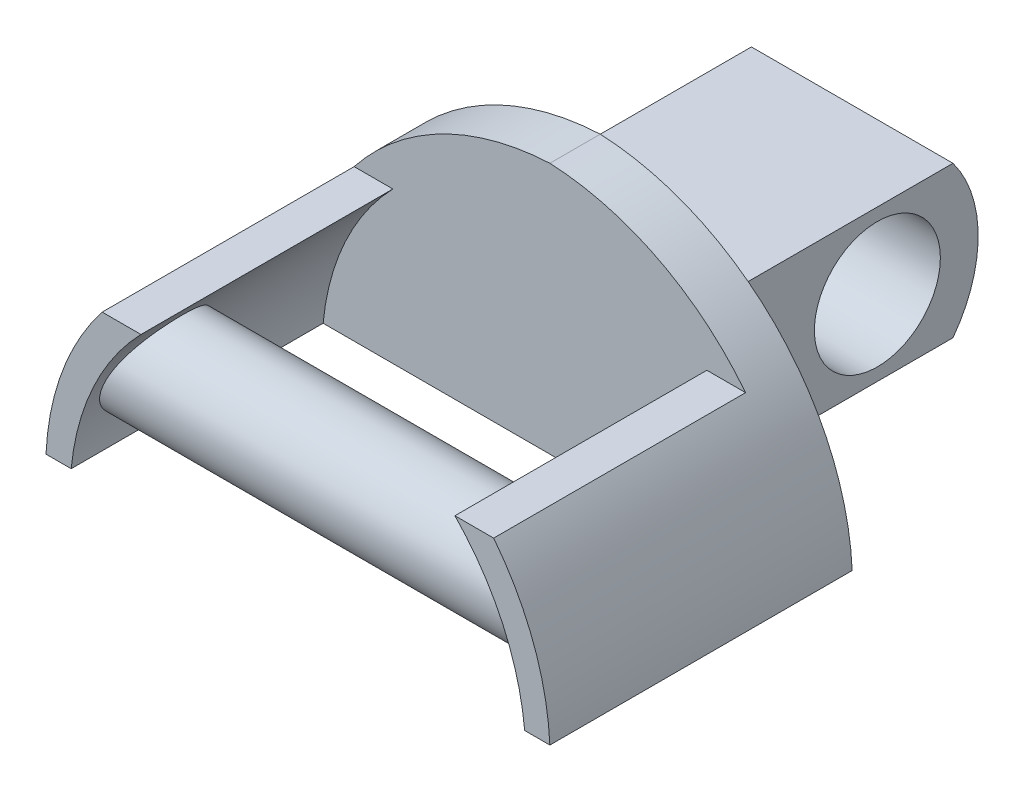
from build123d import *

# Parameters (mm, degrees)
SALIENTE_EXTRUIR1_DEPTH                  = 12
CORTAR_EXTRUIR1_DEPTH                    = 10
SALIENTE_EXTRUIR2_DEPTH                  = 4
SALIENTE_EXTRUIR2_DEPTH_BACK             = 4
CROQUIS3_R                               = 2.5
SALIENTE_EXTRUIR3_REACH                  = 20.547
SALIENTE_EXTRUIR3_END_RADIUS             = 10
CROQUIS4_R                               = 2
SALIENTE_EXTRUIR3_DIRECTION_2_REACH      = 20.547
SALIENTE_EXTRUIR3_DIRECTION_2_END_RADIUS = 10
CROQUIS5_W                               = 16
CROQUIS5_H                               = 10
CORTAR_EXTRUIR2_DEPTH                    = 4


with BuildPart() as part:
    # Croquis1 → Saliente-Extruir1 (new body)
    with BuildSketch(Plane.XY):
        with BuildLine():
            Line((10, 0), (-10, 0))
            ThreePointArc((-10, 0), (-6.937538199, 6.937538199), (0, 10))
            ThreePointArc((0, 10), (6.937538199, 6.937538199), (10, 0))
        make_face()
    extrude(amount=SALIENTE_EXTRUIR1_DEPTH)

    # Croquis2 → Cortar-Extruir1 (cut)
    with BuildSketch(Plane.XY.offset(12)):
        with BuildLine():
            Line((-9, 0), (9, 0))
            ThreePointArc((9, 0), (6.116711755, 6.116711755), (0, 9))
            ThreePointArc((0, 9), (-6.116711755, 6.116711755), (-9, 0))
        make_face()
    extrude(amount=-CORTAR_EXTRUIR1_DEPTH, mode=Mode.SUBTRACT)

    # Croquis3 → Saliente-Extruir2 (add, two sides: drawn at the far end of the back side and taken through both)
    with BuildSketch(Plane(origin=(0, 0, 0), x_dir=(0, 0, -1), z_dir=(1, 0, 0)).offset(-SALIENTE_EXTRUIR2_DEPTH_BACK)):
        with BuildLine():
            Line((0, 0), (10, 0))
            ThreePointArc((10, 0), (11, 3), (10, 6))
            Line((10, 6), (0, 6))
            Line((0, 6), (0, 0))
        make_face()
        with Locations((7, 3)):
            Circle(CROQUIS3_R, mode=Mode.SUBTRACT)
    extrude(amount=SALIENTE_EXTRUIR2_DEPTH + SALIENTE_EXTRUIR2_DEPTH_BACK)

    # Saliente-Extruir3: up to this cylinder (the profile starts inside it)
    saliente_extruir3_end = Plane(origin=(-0.954356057, -0.954356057, 9.5), z_dir=(0, 0, 1)) * Cylinder(SALIENTE_EXTRUIR3_END_RADIUS, 62.094, mode=Mode.PRIVATE)
    # Croquis4 → Saliente-Extruir3 (add, up to the surface)
    with BuildSketch(Plane(origin=(0, 0, 0), x_dir=(0, 0, -1), z_dir=(1, 0, 0)), mode=Mode.PRIVATE) as saliente_extruir3_sk1:
        with Locations(Location((-9.5, 3, 0), (0, 0, 180))):
            Circle(CROQUIS4_R)
    saliente_extruir3_tool1 = extrude(saliente_extruir3_sk1.sketch, amount=SALIENTE_EXTRUIR3_REACH, mode=Mode.PRIVATE) & saliente_extruir3_end
    add(saliente_extruir3_tool1.solids().sort_by_distance((0, 3, 9.5))[0])

    # Saliente-Extruir3 direction 2: up to this cylinder (the profile starts inside it)
    saliente_extruir3_direction_2_end = Plane(origin=(0.954356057, -0.954356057, 9.5), z_dir=(0, 0, 1)) * Cylinder(SALIENTE_EXTRUIR3_DIRECTION_2_END_RADIUS, 62.094, mode=Mode.PRIVATE)
    # Croquis4 → Saliente-Extruir3 direction 2 (add, up to the surface)
    with BuildSketch(Plane(origin=(0, 0, 0), x_dir=(0, 0, -1), z_dir=(1, 0, 0)), mode=Mode.PRIVATE) as saliente_extruir3_direction_2_sk1:
        with Locations(Location((-9.5, 3, 0), (0, 0, 180))):
            Circle(CROQUIS4_R)
    saliente_extruir3_direction_2_tool1 = extrude(saliente_extruir3_direction_2_sk1.sketch, amount=-SALIENTE_EXTRUIR3_DIRECTION_2_REACH, mode=Mode.PRIVATE) & saliente_extruir3_direction_2_end
    add(saliente_extruir3_direction_2_tool1.solids().sort_by_distance((0, 3, 9.5))[0])

    # Croquis5 → Cortar-Extruir2 (cut)
    with BuildSketch(Plane(origin=(0, 10, 0), x_dir=(1, 0, 0), z_dir=(0, 1, 0))):
        with Locations((0, -7)):
            Rectangle(CROQUIS5_W, CROQUIS5_H)
    extrude(amount=-CORTAR_EXTRUIR2_DEPTH, mode=Mode.SUBTRACT)


solid = part.part
